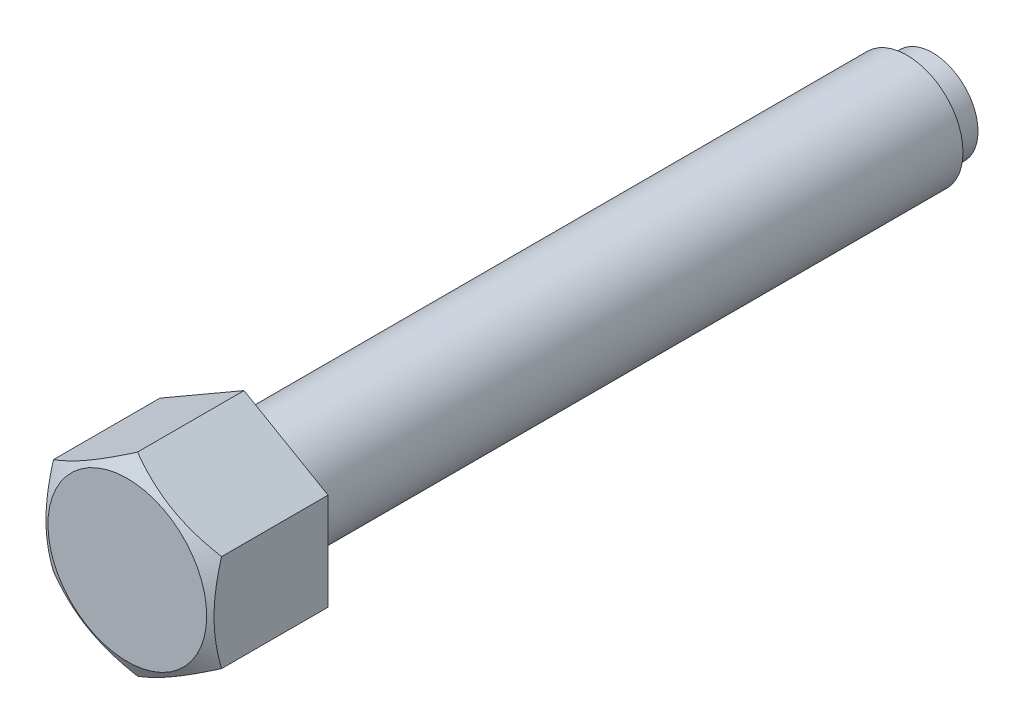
ISO-10303-21;
HEADER;
FILE_DESCRIPTION(('STEP AP214'),'2;1');
FILE_NAME('part.step','',(''),(''),'','','');
FILE_SCHEMA(('AUTOMOTIVE_DESIGN { 1 0 10303 214 1 1 1 1 }'));
ENDSEC;
DATA;
#1=APPLICATION_CONTEXT('core data for automotive mechanical design processes');
#2=APPLICATION_PROTOCOL_DEFINITION('international standard','automotive_design',2000,#1);
#3=PRODUCT_CONTEXT('',#1,'mechanical');
#4=PRODUCT('Part','Part','',(#3));
#5=PRODUCT_RELATED_PRODUCT_CATEGORY('part','',(#4));
#6=PRODUCT_DEFINITION_FORMATION('','',#4);
#7=PRODUCT_DEFINITION_CONTEXT('part definition',#1,'design');
#8=PRODUCT_DEFINITION('design','',#6,#7);
#9=PRODUCT_DEFINITION_SHAPE('','',#8);
#10=(LENGTH_UNIT() NAMED_UNIT(*) SI_UNIT(.MILLI.,.METRE.));
#11=(NAMED_UNIT(*) PLANE_ANGLE_UNIT() SI_UNIT($,.RADIAN.));
#12=(NAMED_UNIT(*) SI_UNIT($,.STERADIAN.) SOLID_ANGLE_UNIT());
#13=UNCERTAINTY_MEASURE_WITH_UNIT(LENGTH_MEASURE(1.E-05),#10,'distance_accuracy_value','');
#14=(GEOMETRIC_REPRESENTATION_CONTEXT(3) GLOBAL_UNCERTAINTY_ASSIGNED_CONTEXT((#13)) GLOBAL_UNIT_ASSIGNED_CONTEXT((#10,
#11,#12)) REPRESENTATION_CONTEXT('',''));
#15=CARTESIAN_POINT('',(0.,0.,0.));
#16=DIRECTION('',(0.,0.,1.));
#17=DIRECTION('',(1.,0.,0.));
#18=AXIS2_PLACEMENT_3D('',#15,#16,#17);
#19=CARTESIAN_POINT('',(0.,20.7846096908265,145.));
#20=DIRECTION('',(-0.5,-0.86602540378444,0.));
#21=DIRECTION('',(0.86602540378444,-0.5,0.));
#22=AXIS2_PLACEMENT_3D('',#19,#20,#21);
#23=PLANE('',#22);
#24=CARTESIAN_POINT('',(18.0002,10.3921893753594,172.814887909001));
#25=CARTESIAN_POINT('',(17.6045674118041,10.6206079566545,172.946756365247));
#26=CARTESIAN_POINT('',(17.2073916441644,10.8499174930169,173.072640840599));
#27=CARTESIAN_POINT('',(16.4098552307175,11.310375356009,173.310778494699));
#28=CARTESIAN_POINT('',(16.0094935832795,11.5415242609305,173.423027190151));
#29=CARTESIAN_POINT('',(15.2048116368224,12.0061075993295,173.632384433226));
#30=CARTESIAN_POINT('',(14.8004842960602,12.2395460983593,173.729457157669));
#31=CARTESIAN_POINT('',(13.9890201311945,12.7080451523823,173.906377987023));
#32=CARTESIAN_POINT('',(13.5818834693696,12.9431056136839,173.98622707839));
#33=CARTESIAN_POINT('',(12.7752328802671,13.4088255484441,174.125304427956));
#34=CARTESIAN_POINT('',(12.3757788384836,13.6394504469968,174.184993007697));
#35=CARTESIAN_POINT('',(11.5750403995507,14.1017570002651,174.285077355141));
#36=CARTESIAN_POINT('',(11.1737559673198,14.3334386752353,174.325472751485));
#37=CARTESIAN_POINT('',(10.370513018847,14.7971912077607,174.385950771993));
#38=CARTESIAN_POINT('',(9.96855587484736,15.0292612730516,174.406057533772));
#39=CARTESIAN_POINT('',(9.16427056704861,15.4936156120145,174.425525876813));
#40=CARTESIAN_POINT('',(8.7619424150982,15.7258998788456,174.424888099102));
#41=CARTESIAN_POINT('',(8.00978065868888,16.1601606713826,174.404316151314));
#42=CARTESIAN_POINT('',(7.65989346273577,16.3621681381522,174.38689054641));
#43=CARTESIAN_POINT('',(6.96095368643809,16.765701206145,174.336680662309));
#44=CARTESIAN_POINT('',(6.61190109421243,16.9672268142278,174.303896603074));
#45=CARTESIAN_POINT('',(5.91476277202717,17.3697198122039,174.223538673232));
#46=CARTESIAN_POINT('',(5.56667820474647,17.5706865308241,174.175951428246));
#47=CARTESIAN_POINT('',(4.87216610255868,17.9716632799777,174.066826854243));
#48=CARTESIAN_POINT('',(4.52573856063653,18.1716733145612,174.005289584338));
#49=CARTESIAN_POINT('',(3.47411308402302,18.7788295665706,173.798187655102));
#50=CARTESIAN_POINT('',(2.77196054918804,19.1842175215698,173.631972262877));
#51=CARTESIAN_POINT('',(1.37812528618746,19.9889486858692,173.254731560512));
#52=CARTESIAN_POINT('',(0.686424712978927,20.3883021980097,173.043794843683));
#53=CARTESIAN_POINT('',(-0.000199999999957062,20.7847251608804,172.814887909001));
#54=B_SPLINE_CURVE_WITH_KNOTS('',3,(#24,#25,#26,#27,#28,#29,#30,#31,#32,#33,#34,#35,#36,#37,#38,
#39,#40,#41,#42,#43,#44,#45,#46,#47,#48,#49,#50,#51,#52,#53),.UNSPECIFIED.,.F.,.F.,(4,2,2,2,2,2,
2,2,2,2,2,2,2,2,4),(0.,1.42650335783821,2.85347447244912,4.28376471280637,5.71397301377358,
7.10888071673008,8.50381526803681,9.8970882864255,11.2903182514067,12.5031974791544,
13.7160593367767,14.9300201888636,16.1439758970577,18.6253607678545,21.1018751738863),.UNSPECIFIED.);
#55=CARTESIAN_POINT('',(18.,10.3923048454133,172.814954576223));
#56=VERTEX_POINT('',#55);
#57=CARTESIAN_POINT('',(0.,20.7846096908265,172.814954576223));
#58=VERTEX_POINT('',#57);
#59=EDGE_CURVE('E30',#56,#58,#54,.T.);
#60=ORIENTED_EDGE('',*,*,#59,.F.);
#61=DIRECTION('',(0.,0.,1.));
#62=VECTOR('',#61,1.);
#63=CARTESIAN_POINT('',(18.,10.3923048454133,145.));
#64=LINE('',#63,#62);
#65=CARTESIAN_POINT('',(18.,10.3923048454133,150.));
#66=VERTEX_POINT('',#65);
#67=EDGE_CURVE('E97',#66,#56,#64,.T.);
#68=ORIENTED_EDGE('',*,*,#67,.F.);
#69=DIRECTION('',(0.86602540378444,-0.5,0.));
#70=VECTOR('',#69,1.);
#71=CARTESIAN_POINT('',(18.,10.3923048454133,150.));
#72=LINE('',#71,#70);
#73=CARTESIAN_POINT('',(0.,20.7846096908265,150.));
#74=VERTEX_POINT('',#73);
#75=EDGE_CURVE('E111',#74,#66,#72,.T.);
#76=ORIENTED_EDGE('',*,*,#75,.F.);
#77=DIRECTION('',(0.,0.,1.));
#78=VECTOR('',#77,1.);
#79=CARTESIAN_POINT('',(0.,20.7846096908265,145.));
#80=LINE('',#79,#78);
#81=EDGE_CURVE('E37',#74,#58,#80,.T.);
#82=ORIENTED_EDGE('',*,*,#81,.T.);
#83=EDGE_LOOP('',(#60,#68,#76,#82));
#84=FACE_BOUND('',#83,.T.);
#85=ADVANCED_FACE('F15',(#84),#23,.F.);
#86=CARTESIAN_POINT('',(18.,10.3923048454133,145.));
#87=DIRECTION('',(-1.,0.,0.));
#88=DIRECTION('',(0.,-1.,0.));
#89=AXIS2_PLACEMENT_3D('',#86,#87,#88);
#90=PLANE('',#89);
#91=CARTESIAN_POINT('',(18.,-27.8084702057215,165.68983135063));
#92=CARTESIAN_POINT('',(18.,-27.4158321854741,165.880129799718));
#93=CARTESIAN_POINT('',(18.,-27.0227305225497,166.06947116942));
#94=CARTESIAN_POINT('',(18.,-26.2355031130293,166.446022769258));
#95=CARTESIAN_POINT('',(18.,-25.841377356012,166.633232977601));
#96=CARTESIAN_POINT('',(18.,-24.6572123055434,167.1913914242));
#97=CARTESIAN_POINT('',(18.,-23.8655030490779,167.558810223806));
#98=CARTESIAN_POINT('',(18.,-22.2723907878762,168.283994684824));
#99=CARTESIAN_POINT('',(18.,-21.4709584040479,168.641695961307));
#100=CARTESIAN_POINT('',(18.,-19.8616825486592,169.342322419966));
#101=CARTESIAN_POINT('',(18.,-19.0538393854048,169.685248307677));
#102=CARTESIAN_POINT('',(18.,-17.4048230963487,170.362945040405));
#103=CARTESIAN_POINT('',(18.,-16.5634026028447,170.697117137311));
#104=CARTESIAN_POINT('',(18.,-14.8706723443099,171.339912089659));
#105=CARTESIAN_POINT('',(18.,-14.0193614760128,171.648532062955));
#106=CARTESIAN_POINT('',(18.,-12.3071522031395,172.232038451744));
#107=CARTESIAN_POINT('',(18.,-11.4462775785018,172.506994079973));
#108=CARTESIAN_POINT('',(18.,-9.71209852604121,173.014293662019));
#109=CARTESIAN_POINT('',(18.,-8.83879814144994,173.246651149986));
#110=CARTESIAN_POINT('',(18.,-7.52178610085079,173.55414713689));
#111=CARTESIAN_POINT('',(18.,-7.08278899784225,173.649604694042));
#112=CARTESIAN_POINT('',(18.,-6.20181532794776,173.825690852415));
#113=CARTESIAN_POINT('',(18.,-5.75983882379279,173.906319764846));
#114=CARTESIAN_POINT('',(18.,-4.87322678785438,174.051317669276));
#115=CARTESIAN_POINT('',(18.,-4.42859133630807,174.115687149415));
#116=CARTESIAN_POINT('',(18.,-3.53711680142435,174.226882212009));
#117=CARTESIAN_POINT('',(18.,-3.09027771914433,174.273707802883));
#118=CARTESIAN_POINT('',(18.,-2.20083325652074,174.348299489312));
#119=CARTESIAN_POINT('',(18.,-1.75824805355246,174.376304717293));
#120=CARTESIAN_POINT('',(18.,-0.872291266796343,174.413580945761));
#121=CARTESIAN_POINT('',(18.,-0.428919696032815,174.422852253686));
#122=CARTESIAN_POINT('',(18.,0.457820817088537,174.42244051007));
#123=CARTESIAN_POINT('',(18.,0.901189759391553,174.412757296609));
#124=CARTESIAN_POINT('',(18.,1.78712731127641,174.374670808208));
#125=CARTESIAN_POINT('',(18.,2.22969588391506,174.346266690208));
#126=CARTESIAN_POINT('',(18.,3.29654995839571,174.255829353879));
#127=CARTESIAN_POINT('',(18.,3.92008059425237,174.184734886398));
#128=CARTESIAN_POINT('',(18.,5.16244762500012,174.009282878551));
#129=CARTESIAN_POINT('',(18.,5.78128335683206,173.904920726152));
#130=CARTESIAN_POINT('',(18.,7.01369263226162,173.666646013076));
#131=CARTESIAN_POINT('',(18.,7.6272616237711,173.532710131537));
#132=CARTESIAN_POINT('',(18.,8.84821250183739,173.239368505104));
#133=CARTESIAN_POINT('',(18.,9.45559448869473,173.079963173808));
#134=CARTESIAN_POINT('',(18.,10.6775127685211,172.735791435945));
#135=CARTESIAN_POINT('',(18.,11.2919127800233,172.550544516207));
#136=CARTESIAN_POINT('',(18.,12.5146588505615,172.161146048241));
#137=CARTESIAN_POINT('',(18.,13.1230048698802,171.956994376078));
#138=CARTESIAN_POINT('',(18.,14.3339482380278,171.533007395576));
#139=CARTESIAN_POINT('',(18.,14.9365474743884,171.313177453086));
#140=CARTESIAN_POINT('',(18.,16.1367677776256,170.860397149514));
#141=CARTESIAN_POINT('',(18.,16.7343889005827,170.627446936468));
#142=CARTESIAN_POINT('',(18.,18.135991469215,170.066209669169));
#143=CARTESIAN_POINT('',(18.,18.9381439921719,169.733362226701));
#144=CARTESIAN_POINT('',(18.,20.5357211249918,169.051849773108));
#145=CARTESIAN_POINT('',(18.,21.3311453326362,168.703183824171));
#146=CARTESIAN_POINT('',(18.,22.9165096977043,167.993181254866));
#147=CARTESIAN_POINT('',(18.,23.7064486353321,167.631841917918));
#148=CARTESIAN_POINT('',(18.,25.281581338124,166.899030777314));
#149=CARTESIAN_POINT('',(18.,26.0667752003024,166.527559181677));
#150=CARTESIAN_POINT('',(18.,27.6340339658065,165.775965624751));
#151=CARTESIAN_POINT('',(18.,28.4160946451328,165.395834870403));
#152=CARTESIAN_POINT('',(18.,29.9768748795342,164.628776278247));
#153=CARTESIAN_POINT('',(18.,30.7555944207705,164.24184841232));
#154=CARTESIAN_POINT('',(18.,32.3101083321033,163.462400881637));
#155=CARTESIAN_POINT('',(18.,33.0859030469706,163.06988190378));
#156=CARTESIAN_POINT('',(18.,34.6350785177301,162.280117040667));
#157=CARTESIAN_POINT('',(18.,35.4084592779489,161.88287116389));
#158=CARTESIAN_POINT('',(18.,37.5974581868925,160.751362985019));
#159=CARTESIAN_POINT('',(18.,39.0106461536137,160.012399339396));
#160=CARTESIAN_POINT('',(18.,41.8317901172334,158.524459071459));
#161=CARTESIAN_POINT('',(18.,43.2397459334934,157.775482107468));
#162=CARTESIAN_POINT('',(18.,46.0481369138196,156.271677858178));
#163=CARTESIAN_POINT('',(18.,47.4485820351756,155.516869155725));
#164=CARTESIAN_POINT('',(18.,49.5467780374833,154.380188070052));
#165=CARTESIAN_POINT('',(18.,50.2457464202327,154.000559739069));
#166=CARTESIAN_POINT('',(18.,51.6429519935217,153.239962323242));
#167=CARTESIAN_POINT('',(18.,52.3411891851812,152.858993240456));
#168=CARTESIAN_POINT('',(18.,53.0391020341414,152.477430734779));
#169=B_SPLINE_CURVE_WITH_KNOTS('',3,(#91,#92,#93,#94,#95,#96,#97,#98,#99,#100,#101,#102,#103,
#104,#105,#106,#107,#108,#109,#110,#111,#112,#113,#114,#115,#116,#117,#118,#119,#120,#121,#122,
#123,#124,#125,#126,#127,#128,#129,#130,#131,#132,#133,#134,#135,#136,#137,#138,#139,#140,#141,
#142,#143,#144,#145,#146,#147,#148,#149,#150,#151,#152,#153,#154,#155,#156,#157,#158,#159,#160,
#161,#162,#163,#164,#165,#166,#167,#168),.UNSPECIFIED.,.F.,.F.,(4,2,2,2,2,2,2,2,2,2,2,2,2,2,2,2,
2,2,2,2,2,2,2,2,2,2,2,2,2,2,2,2,2,2,2,2,2,2,4),(0.,1.30896781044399,2.61794899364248,
5.23630431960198,7.86909466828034,10.501759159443,13.2174936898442,15.9335341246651,
18.6438932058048,21.353389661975,22.7009465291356,24.0484751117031,25.3959632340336,
26.7434507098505,28.0734757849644,29.4034790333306,30.7334936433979,32.063568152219,
33.9452364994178,35.8271658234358,37.7105845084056,39.5939726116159,41.5187666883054,
43.4435733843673,45.3677244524,47.2918538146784,49.8970272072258,52.5023552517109,
55.1082452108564,57.7140817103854,60.3226940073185,62.9313170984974,65.539622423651,
68.1479230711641,72.9320558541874,77.7163523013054,82.4890511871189,84.8752752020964,
87.2614955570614),.UNSPECIFIED.);
#170=CARTESIAN_POINT('',(18.,-10.3923048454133,172.814954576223));
#171=VERTEX_POINT('',#170);
#172=EDGE_CURVE('E157',#171,#56,#169,.T.);
#173=ORIENTED_EDGE('',*,*,#172,.F.);
#174=DIRECTION('',(0.,0.,1.));
#175=VECTOR('',#174,1.);
#176=CARTESIAN_POINT('',(18.,-10.3923048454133,145.));
#177=LINE('',#176,#175);
#178=CARTESIAN_POINT('',(18.,-10.3923048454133,150.));
#179=VERTEX_POINT('',#178);
#180=EDGE_CURVE('E94',#179,#171,#177,.T.);
#181=ORIENTED_EDGE('',*,*,#180,.F.);
#182=DIRECTION('',(0.,-1.,0.));
#183=VECTOR('',#182,1.);
#184=CARTESIAN_POINT('',(18.,0.,150.));
#185=LINE('',#184,#183);
#186=EDGE_CURVE('E108',#66,#179,#185,.T.);
#187=ORIENTED_EDGE('',*,*,#186,.F.);
#188=ORIENTED_EDGE('',*,*,#67,.T.);
#189=EDGE_LOOP('',(#173,#181,#187,#188));
#190=FACE_BOUND('',#189,.T.);
#191=ADVANCED_FACE('F137',(#190),#90,.F.);
#192=CARTESIAN_POINT('',(0.,-20.7846096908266,145.));
#193=DIRECTION('',(0.5,-0.866025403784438,0.));
#194=DIRECTION('',(0.866025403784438,0.5,0.));
#195=AXIS2_PLACEMENT_3D('',#192,#193,#194);
#196=PLANE('',#195);
#197=ORIENTED_EDGE('',*,*,#180,.T.);
#198=CARTESIAN_POINT('',(18.0002,-10.3921893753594,172.814887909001));
#199=CARTESIAN_POINT('',(17.6045674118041,-10.6206079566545,172.946756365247));
#200=CARTESIAN_POINT('',(17.2073916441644,-10.8499174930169,173.072640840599));
#201=CARTESIAN_POINT('',(16.4098552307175,-11.310375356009,173.310778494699));
#202=CARTESIAN_POINT('',(16.0094935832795,-11.5415242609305,173.423027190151));
#203=CARTESIAN_POINT('',(15.2048116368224,-12.0061075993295,173.632384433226));
#204=CARTESIAN_POINT('',(14.8004842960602,-12.2395460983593,173.729457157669));
#205=CARTESIAN_POINT('',(13.9890201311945,-12.7080451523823,173.906377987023));
#206=CARTESIAN_POINT('',(13.5818834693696,-12.9431056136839,173.98622707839));
#207=CARTESIAN_POINT('',(12.7752328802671,-13.4088255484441,174.125304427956));
#208=CARTESIAN_POINT('',(12.3757788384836,-13.6394504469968,174.184993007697));
#209=CARTESIAN_POINT('',(11.5750403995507,-14.1017570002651,174.285077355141));
#210=CARTESIAN_POINT('',(11.1737559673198,-14.3334386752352,174.325472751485));
#211=CARTESIAN_POINT('',(10.370513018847,-14.7971912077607,174.385950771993));
#212=CARTESIAN_POINT('',(9.96855587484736,-15.0292612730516,174.406057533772));
#213=CARTESIAN_POINT('',(9.16427056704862,-15.4936156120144,174.425525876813));
#214=CARTESIAN_POINT('',(8.76194241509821,-15.7258998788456,174.424888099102));
#215=CARTESIAN_POINT('',(8.00978065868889,-16.1601606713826,174.404316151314));
#216=CARTESIAN_POINT('',(7.65989346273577,-16.3621681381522,174.38689054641));
#217=CARTESIAN_POINT('',(6.96095368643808,-16.765701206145,174.336680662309));
#218=CARTESIAN_POINT('',(6.61190109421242,-16.9672268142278,174.303896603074));
#219=CARTESIAN_POINT('',(5.91476277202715,-17.3697198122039,174.223538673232));
#220=CARTESIAN_POINT('',(5.56667820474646,-17.5706865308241,174.175951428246));
#221=CARTESIAN_POINT('',(4.87216610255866,-17.9716632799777,174.066826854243));
#222=CARTESIAN_POINT('',(4.5257385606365,-18.1716733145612,174.005289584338));
#223=CARTESIAN_POINT('',(3.47411308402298,-18.7788295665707,173.798187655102));
#224=CARTESIAN_POINT('',(2.771960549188,-19.1842175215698,173.631972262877));
#225=CARTESIAN_POINT('',(1.3781252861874,-19.9889486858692,173.254731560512));
#226=CARTESIAN_POINT('',(0.686424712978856,-20.3883021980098,173.043794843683));
#227=CARTESIAN_POINT('',(-0.000200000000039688,-20.7847251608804,172.814887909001));
#228=B_SPLINE_CURVE_WITH_KNOTS('',3,(#198,#199,#200,#201,#202,#203,#204,#205,#206,#207,#208,
#209,#210,#211,#212,#213,#214,#215,#216,#217,#218,#219,#220,#221,#222,#223,#224,#225,#226,#227),
.UNSPECIFIED.,.F.,.F.,(4,2,2,2,2,2,2,2,2,2,2,2,2,2,4),(0.,1.42650335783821,2.85347447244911,
4.28376471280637,5.71397301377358,7.10888071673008,8.5038152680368,9.89708828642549,
11.2903182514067,12.5031974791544,13.7160593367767,14.9300201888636,16.1439758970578,
18.6253607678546,21.1018751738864),.UNSPECIFIED.);
#229=CARTESIAN_POINT('',(0.,-20.7846096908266,172.814954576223));
#230=VERTEX_POINT('',#229);
#231=EDGE_CURVE('E163',#171,#230,#228,.T.);
#232=ORIENTED_EDGE('',*,*,#231,.T.);
#233=DIRECTION('',(0.,0.,1.));
#234=VECTOR('',#233,1.);
#235=CARTESIAN_POINT('',(0.,-20.7846096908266,145.));
#236=LINE('',#235,#234);
#237=CARTESIAN_POINT('',(0.,-20.7846096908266,150.));
#238=VERTEX_POINT('',#237);
#239=EDGE_CURVE('E87',#238,#230,#236,.T.);
#240=ORIENTED_EDGE('',*,*,#239,.F.);
#241=DIRECTION('',(0.866025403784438,0.5,0.));
#242=VECTOR('',#241,1.);
#243=CARTESIAN_POINT('',(18.,-10.3923048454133,150.));
#244=LINE('',#243,#242);
#245=EDGE_CURVE('E106',#238,#179,#244,.T.);
#246=ORIENTED_EDGE('',*,*,#245,.T.);
#247=EDGE_LOOP('',(#197,#232,#240,#246));
#248=FACE_BOUND('',#247,.T.);
#249=ADVANCED_FACE('F143',(#248),#196,.T.);
#250=CARTESIAN_POINT('',(0.,-20.7846096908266,145.));
#251=DIRECTION('',(0.5,0.866025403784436,0.));
#252=DIRECTION('',(-0.866025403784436,0.5,0.));
#253=AXIS2_PLACEMENT_3D('',#250,#251,#252);
#254=PLANE('',#253);
#255=CARTESIAN_POINT('',(-18.0002,-10.3921893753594,172.814887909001));
#256=CARTESIAN_POINT('',(-17.6045674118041,-10.6206079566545,172.946756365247));
#257=CARTESIAN_POINT('',(-17.2073916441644,-10.8499174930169,173.072640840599));
#258=CARTESIAN_POINT('',(-16.4098552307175,-11.310375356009,173.310778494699));
#259=CARTESIAN_POINT('',(-16.0094935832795,-11.5415242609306,173.423027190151));
#260=CARTESIAN_POINT('',(-15.2048116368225,-12.0061075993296,173.632384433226));
#261=CARTESIAN_POINT('',(-14.8004842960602,-12.2395460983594,173.729457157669));
#262=CARTESIAN_POINT('',(-13.9890201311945,-12.7080451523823,173.906377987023));
#263=CARTESIAN_POINT('',(-13.5818834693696,-12.9431056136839,173.98622707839));
#264=CARTESIAN_POINT('',(-12.7752328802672,-13.4088255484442,174.125304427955));
#265=CARTESIAN_POINT('',(-12.3757788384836,-13.6394504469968,174.184993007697));
#266=CARTESIAN_POINT('',(-11.5750403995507,-14.1017570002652,174.285077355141));
#267=CARTESIAN_POINT('',(-11.1737559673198,-14.3334386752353,174.325472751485));
#268=CARTESIAN_POINT('',(-10.3705130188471,-14.7971912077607,174.385950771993));
#269=CARTESIAN_POINT('',(-9.96855587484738,-15.0292612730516,174.406057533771));
#270=CARTESIAN_POINT('',(-9.16427056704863,-15.4936156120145,174.425525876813));
#271=CARTESIAN_POINT('',(-8.76194241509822,-15.7258998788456,174.424888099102));
#272=CARTESIAN_POINT('',(-8.0097806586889,-16.1601606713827,174.404316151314));
#273=CARTESIAN_POINT('',(-7.65989346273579,-16.3621681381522,174.38689054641));
#274=CARTESIAN_POINT('',(-6.96095368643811,-16.765701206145,174.336680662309));
#275=CARTESIAN_POINT('',(-6.61190109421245,-16.9672268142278,174.303896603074));
#276=CARTESIAN_POINT('',(-5.91476277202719,-17.3697198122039,174.223538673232));
#277=CARTESIAN_POINT('',(-5.56667820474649,-17.5706865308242,174.175951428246));
#278=CARTESIAN_POINT('',(-4.8721661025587,-17.9716632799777,174.066826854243));
#279=CARTESIAN_POINT('',(-4.52573856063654,-18.1716733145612,174.005289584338));
#280=CARTESIAN_POINT('',(-3.47411308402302,-18.7788295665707,173.798187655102));
#281=CARTESIAN_POINT('',(-2.77196054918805,-19.1842175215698,173.631972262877));
#282=CARTESIAN_POINT('',(-1.37812528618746,-19.9889486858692,173.254731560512));
#283=CARTESIAN_POINT('',(-0.686424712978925,-20.3883021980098,173.043794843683));
#284=CARTESIAN_POINT('',(0.000199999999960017,-20.7847251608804,172.814887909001));
#285=B_SPLINE_CURVE_WITH_KNOTS('',3,(#255,#256,#257,#258,#259,#260,#261,#262,#263,#264,#265,
#266,#267,#268,#269,#270,#271,#272,#273,#274,#275,#276,#277,#278,#279,#280,#281,#282,#283,#284),
.UNSPECIFIED.,.F.,.F.,(4,2,2,2,2,2,2,2,2,2,2,2,2,2,4),(0.,1.42650335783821,2.85347447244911,
4.28376471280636,5.71397301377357,7.10888071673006,8.50381526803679,9.89708828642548,
11.2903182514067,12.5031974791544,13.7160593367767,14.9300201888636,16.1439758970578,
18.6253607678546,21.1018751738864),.UNSPECIFIED.);
#286=CARTESIAN_POINT('',(-18.,-10.3923048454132,172.814954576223));
#287=VERTEX_POINT('',#286);
#288=EDGE_CURVE('E81',#287,#230,#285,.T.);
#289=ORIENTED_EDGE('',*,*,#288,.F.);
#290=DIRECTION('',(0.,0.,1.));
#291=VECTOR('',#290,1.);
#292=CARTESIAN_POINT('',(-18.,-10.3923048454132,145.));
#293=LINE('',#292,#291);
#294=CARTESIAN_POINT('',(-18.,-10.3923048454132,150.));
#295=VERTEX_POINT('',#294);
#296=EDGE_CURVE('E80',#295,#287,#293,.T.);
#297=ORIENTED_EDGE('',*,*,#296,.F.);
#298=DIRECTION('',(-0.866025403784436,0.5,0.));
#299=VECTOR('',#298,1.);
#300=CARTESIAN_POINT('',(-1.35308431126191E-13,-20.7846096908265,150.));
#301=LINE('',#300,#299);
#302=EDGE_CURVE('E103',#238,#295,#301,.T.);
#303=ORIENTED_EDGE('',*,*,#302,.F.);
#304=ORIENTED_EDGE('',*,*,#239,.T.);
#305=EDGE_LOOP('',(#289,#297,#303,#304));
#306=FACE_BOUND('',#305,.T.);
#307=ADVANCED_FACE('F239',(#306),#254,.F.);
#308=CARTESIAN_POINT('',(-18.,10.3923048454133,145.));
#309=DIRECTION('',(-1.,0.,0.));
#310=DIRECTION('',(0.,0.,1.));
#311=AXIS2_PLACEMENT_3D('',#308,#309,#310);
#312=PLANE('',#311);
#313=ORIENTED_EDGE('',*,*,#296,.T.);
#314=CARTESIAN_POINT('',(-18.,-27.8084702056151,165.689831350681));
#315=CARTESIAN_POINT('',(-18.,-27.4158321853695,165.880129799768));
#316=CARTESIAN_POINT('',(-18.,-27.0227305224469,166.06947116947));
#317=CARTESIAN_POINT('',(-18.,-26.23550311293,166.446022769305));
#318=CARTESIAN_POINT('',(-18.,-25.8413773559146,166.633232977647));
#319=CARTESIAN_POINT('',(-18.,-24.6572123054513,167.191391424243));
#320=CARTESIAN_POINT('',(-18.,-23.8655030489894,167.558810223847));
#321=CARTESIAN_POINT('',(-18.,-22.2723907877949,168.28399468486));
#322=CARTESIAN_POINT('',(-18.,-21.4709584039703,168.641695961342));
#323=CARTESIAN_POINT('',(-18.,-19.8616825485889,169.342322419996));
#324=CARTESIAN_POINT('',(-18.,-19.0538393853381,169.685248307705));
#325=CARTESIAN_POINT('',(-18.,-17.4048230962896,170.362945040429));
#326=CARTESIAN_POINT('',(-18.,-16.5634026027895,170.697117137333));
#327=CARTESIAN_POINT('',(-18.,-14.8706723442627,171.339912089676));
#328=CARTESIAN_POINT('',(-18.,-14.0193614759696,171.648532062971));
#329=CARTESIAN_POINT('',(-18.,-12.3071522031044,172.232038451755));
#330=CARTESIAN_POINT('',(-18.,-11.4462775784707,172.506994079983));
#331=CARTESIAN_POINT('',(-18.,-9.71209852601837,173.014293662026));
#332=CARTESIAN_POINT('',(-18.,-8.83879814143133,173.246651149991));
#333=CARTESIAN_POINT('',(-18.,-7.52178610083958,173.554147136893));
#334=CARTESIAN_POINT('',(-18.,-7.08278899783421,173.649604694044));
#335=CARTESIAN_POINT('',(-18.,-6.20181532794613,173.825690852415));
#336=CARTESIAN_POINT('',(-18.,-5.7598388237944,173.906319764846));
#337=CARTESIAN_POINT('',(-18.,-4.87322678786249,174.051317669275));
#338=CARTESIAN_POINT('',(-18.,-4.42859133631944,174.115687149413));
#339=CARTESIAN_POINT('',(-18.,-3.53711680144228,174.226882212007));
#340=CARTESIAN_POINT('',(-18.,-3.09027771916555,174.273707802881));
#341=CARTESIAN_POINT('',(-18.,-2.20083325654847,174.34829948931));
#342=CARTESIAN_POINT('',(-18.,-1.75824805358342,174.376304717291));
#343=CARTESIAN_POINT('',(-18.,-0.872291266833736,174.41358094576));
#344=CARTESIAN_POINT('',(-18.,-0.428919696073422,174.422852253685));
#345=CARTESIAN_POINT('',(-18.,0.457820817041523,174.42244051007));
#346=CARTESIAN_POINT('',(-18.,0.901189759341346,174.41275729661));
#347=CARTESIAN_POINT('',(-18.,1.78712731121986,174.374670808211));
#348=CARTESIAN_POINT('',(-18.,2.22969588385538,174.346266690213));
#349=CARTESIAN_POINT('',(-18.,3.29654995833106,174.255829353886));
#350=CARTESIAN_POINT('',(-18.,3.92008059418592,174.184734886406));
#351=CARTESIAN_POINT('',(-18.,5.16244762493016,174.009282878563));
#352=CARTESIAN_POINT('',(-18.,5.78128335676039,173.904920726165));
#353=CARTESIAN_POINT('',(-18.,7.0136926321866,173.666646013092));
#354=CARTESIAN_POINT('',(-18.,7.62726162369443,173.532710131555));
#355=CARTESIAN_POINT('',(-18.,8.84821250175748,173.239368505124));
#356=CARTESIAN_POINT('',(-18.,9.45559448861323,173.079963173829));
#357=CARTESIAN_POINT('',(-18.,10.6775127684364,172.73579143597));
#358=CARTESIAN_POINT('',(-18.,11.2919127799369,172.550544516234));
#359=CARTESIAN_POINT('',(-18.,12.5146588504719,172.161146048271));
#360=CARTESIAN_POINT('',(-18.,13.123004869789,171.956994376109));
#361=CARTESIAN_POINT('',(-18.,14.3339482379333,171.53300739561));
#362=CARTESIAN_POINT('',(-18.,14.9365474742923,171.313177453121));
#363=CARTESIAN_POINT('',(-18.,16.1367677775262,170.860397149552));
#364=CARTESIAN_POINT('',(-18.,16.7343889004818,170.627446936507));
#365=CARTESIAN_POINT('',(-18.,18.1359914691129,170.06620966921));
#366=CARTESIAN_POINT('',(-18.,18.9381439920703,169.733362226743));
#367=CARTESIAN_POINT('',(-18.,20.535721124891,169.051849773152));
#368=CARTESIAN_POINT('',(-18.,21.3311453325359,168.703183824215));
#369=CARTESIAN_POINT('',(-18.,22.9165096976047,167.993181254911));
#370=CARTESIAN_POINT('',(-18.,23.7064486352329,167.631841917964));
#371=CARTESIAN_POINT('',(-18.,25.2815813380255,166.899030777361));
#372=CARTESIAN_POINT('',(-18.,26.0667752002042,166.527559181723));
#373=CARTESIAN_POINT('',(-18.,27.6340339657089,165.775965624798));
#374=CARTESIAN_POINT('',(-18.,28.4160946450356,165.39583487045));
#375=CARTESIAN_POINT('',(-18.,29.9768748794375,164.628776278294));
#376=CARTESIAN_POINT('',(-18.,30.7555944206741,164.241848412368));
#377=CARTESIAN_POINT('',(-18.,32.3101083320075,163.462400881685));
#378=CARTESIAN_POINT('',(-18.,33.0859030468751,163.069881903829));
#379=CARTESIAN_POINT('',(-18.,34.6350785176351,162.280117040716));
#380=CARTESIAN_POINT('',(-18.,35.4084592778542,161.882871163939));
#381=CARTESIAN_POINT('',(-18.,37.5974581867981,160.751362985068));
#382=CARTESIAN_POINT('',(-18.,39.0106461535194,160.012399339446));
#383=CARTESIAN_POINT('',(-18.,41.8317901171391,158.524459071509));
#384=CARTESIAN_POINT('',(-18.,43.2397459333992,157.775482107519));
#385=CARTESIAN_POINT('',(-18.,46.0481369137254,156.271677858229));
#386=CARTESIAN_POINT('',(-18.,47.4485820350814,155.516869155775));
#387=CARTESIAN_POINT('',(-18.,49.546778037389,154.380188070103));
#388=CARTESIAN_POINT('',(-18.,50.2457464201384,154.00055973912));
#389=CARTESIAN_POINT('',(-18.,51.6429519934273,153.239962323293));
#390=CARTESIAN_POINT('',(-18.,52.3411891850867,152.858993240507));
#391=CARTESIAN_POINT('',(-18.,53.0391020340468,152.477430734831));
#392=B_SPLINE_CURVE_WITH_KNOTS('',3,(#314,#315,#316,#317,#318,#319,#320,#321,#322,#323,#324,
#325,#326,#327,#328,#329,#330,#331,#332,#333,#334,#335,#336,#337,#338,#339,#340,#341,#342,#343,
#344,#345,#346,#347,#348,#349,#350,#351,#352,#353,#354,#355,#356,#357,#358,#359,#360,#361,#362,
#363,#364,#365,#366,#367,#368,#369,#370,#371,#372,#373,#374,#375,#376,#377,#378,#379,#380,#381,
#382,#383,#384,#385,#386,#387,#388,#389,#390,#391),.UNSPECIFIED.,.F.,.F.,(4,2,2,2,2,2,2,2,2,2,2,
2,2,2,2,2,2,2,2,2,2,2,2,2,2,2,2,2,2,2,2,2,2,2,2,2,2,2,4),(0.,1.30896781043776,2.61794899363,
5.23630431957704,7.8690946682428,10.5017591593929,13.2174936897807,15.9335341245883,
18.6438932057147,21.3533896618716,22.7009465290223,24.04847511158,25.3959632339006,
26.7434507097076,28.073475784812,29.4034790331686,30.7334936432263,32.0635681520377,
33.9452364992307,35.8271658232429,37.7105845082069,39.5939726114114,41.5187666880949,
43.4435733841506,45.3677244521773,47.2918538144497,49.8970272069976,52.5023552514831,
55.1082452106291,57.7140817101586,60.3226940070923,62.9313170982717,65.5396224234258,
68.1479230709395,72.9320558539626,77.7163523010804,82.4890511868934,84.8752752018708,
87.2614955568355),.UNSPECIFIED.);
#393=CARTESIAN_POINT('',(-18.,10.3923048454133,172.814954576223));
#394=VERTEX_POINT('',#393);
#395=EDGE_CURVE('E68',#287,#394,#392,.T.);
#396=ORIENTED_EDGE('',*,*,#395,.T.);
#397=DIRECTION('',(0.,0.,1.));
#398=VECTOR('',#397,1.);
#399=CARTESIAN_POINT('',(-18.,10.3923048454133,145.));
#400=LINE('',#399,#398);
#401=CARTESIAN_POINT('',(-18.,10.3923048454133,150.));
#402=VERTEX_POINT('',#401);
#403=EDGE_CURVE('E77',#402,#394,#400,.T.);
#404=ORIENTED_EDGE('',*,*,#403,.F.);
#405=DIRECTION('',(0.,-1.,0.));
#406=VECTOR('',#405,1.);
#407=CARTESIAN_POINT('',(-18.,0.,150.));
#408=LINE('',#407,#406);
#409=EDGE_CURVE('E101',#402,#295,#408,.T.);
#410=ORIENTED_EDGE('',*,*,#409,.T.);
#411=EDGE_LOOP('',(#313,#396,#404,#410));
#412=FACE_BOUND('',#411,.T.);
#413=ADVANCED_FACE('F76',(#412),#312,.T.);
#414=CARTESIAN_POINT('',(0.,20.7846096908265,145.));
#415=DIRECTION('',(-0.5,0.866025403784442,0.));
#416=DIRECTION('',(-0.866025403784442,-0.5,0.));
#417=AXIS2_PLACEMENT_3D('',#414,#415,#416);
#418=PLANE('',#417);
#419=ORIENTED_EDGE('',*,*,#403,.T.);
#420=CARTESIAN_POINT('',(-18.0002,10.3921893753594,172.814887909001));
#421=CARTESIAN_POINT('',(-17.6045674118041,10.6206079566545,172.946756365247));
#422=CARTESIAN_POINT('',(-17.2073916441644,10.8499174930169,173.072640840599));
#423=CARTESIAN_POINT('',(-16.4098552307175,11.310375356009,173.310778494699));
#424=CARTESIAN_POINT('',(-16.0094935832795,11.5415242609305,173.423027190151));
#425=CARTESIAN_POINT('',(-15.2048116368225,12.0061075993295,173.632384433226));
#426=CARTESIAN_POINT('',(-14.8004842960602,12.2395460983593,173.729457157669));
#427=CARTESIAN_POINT('',(-13.9890201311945,12.7080451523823,173.906377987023));
#428=CARTESIAN_POINT('',(-13.5818834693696,12.9431056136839,173.98622707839));
#429=CARTESIAN_POINT('',(-12.7752328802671,13.4088255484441,174.125304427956));
#430=CARTESIAN_POINT('',(-12.3757788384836,13.6394504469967,174.184993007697));
#431=CARTESIAN_POINT('',(-11.5750403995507,14.1017570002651,174.285077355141));
#432=CARTESIAN_POINT('',(-11.1737559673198,14.3334386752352,174.325472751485));
#433=CARTESIAN_POINT('',(-10.370513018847,14.7971912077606,174.385950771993));
#434=CARTESIAN_POINT('',(-9.96855587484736,15.0292612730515,174.406057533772));
#435=CARTESIAN_POINT('',(-9.16427056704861,15.4936156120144,174.425525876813));
#436=CARTESIAN_POINT('',(-8.7619424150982,15.7258998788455,174.424888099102));
#437=CARTESIAN_POINT('',(-8.00978065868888,16.1601606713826,174.404316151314));
#438=CARTESIAN_POINT('',(-7.65989346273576,16.3621681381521,174.38689054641));
#439=CARTESIAN_POINT('',(-6.96095368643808,16.7657012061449,174.336680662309));
#440=CARTESIAN_POINT('',(-6.61190109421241,16.9672268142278,174.303896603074));
#441=CARTESIAN_POINT('',(-5.91476277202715,17.3697198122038,174.223538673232));
#442=CARTESIAN_POINT('',(-5.56667820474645,17.5706865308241,174.175951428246));
#443=CARTESIAN_POINT('',(-4.87216610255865,17.9716632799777,174.066826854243));
#444=CARTESIAN_POINT('',(-4.52573856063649,18.1716733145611,174.005289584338));
#445=CARTESIAN_POINT('',(-3.47411308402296,18.7788295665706,173.798187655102));
#446=CARTESIAN_POINT('',(-2.77196054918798,19.1842175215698,173.631972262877));
#447=CARTESIAN_POINT('',(-1.37812528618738,19.9889486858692,173.254731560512));
#448=CARTESIAN_POINT('',(-0.686424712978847,20.3883021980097,173.043794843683));
#449=CARTESIAN_POINT('',(0.000200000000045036,20.7847251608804,172.814887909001));
#450=B_SPLINE_CURVE_WITH_KNOTS('',3,(#420,#421,#422,#423,#424,#425,#426,#427,#428,#429,#430,
#431,#432,#433,#434,#435,#436,#437,#438,#439,#440,#441,#442,#443,#444,#445,#446,#447,#448,#449),
.UNSPECIFIED.,.F.,.F.,(4,2,2,2,2,2,2,2,2,2,2,2,2,2,4),(0.,1.42650335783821,2.85347447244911,
4.28376471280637,5.71397301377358,7.10888071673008,8.5038152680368,9.89708828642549,
11.2903182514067,12.5031974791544,13.7160593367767,14.9300201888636,16.1439758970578,
18.6253607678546,21.1018751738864),.UNSPECIFIED.);
#451=EDGE_CURVE('E65',#394,#58,#450,.T.);
#452=ORIENTED_EDGE('',*,*,#451,.T.);
#453=ORIENTED_EDGE('',*,*,#81,.F.);
#454=DIRECTION('',(-0.866025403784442,-0.5,0.));
#455=VECTOR('',#454,1.);
#456=CARTESIAN_POINT('',(1.43982048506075E-13,20.7846096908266,150.));
#457=LINE('',#456,#455);
#458=EDGE_CURVE('E85',#74,#402,#457,.T.);
#459=ORIENTED_EDGE('',*,*,#458,.T.);
#460=EDGE_LOOP('',(#419,#452,#453,#459));
#461=FACE_BOUND('',#460,.T.);
#462=ADVANCED_FACE('F83',(#461),#418,.T.);
#463=CARTESIAN_POINT('',(0.,0.,20.));
#464=DIRECTION('',(0.,0.,1.));
#465=DIRECTION('',(1.,0.,0.));
#466=AXIS2_PLACEMENT_3D('',#463,#464,#465);
#467=SPHERICAL_SURFACE('',#466,20.);
#468=CARTESIAN_POINT('',(0.,0.,2.53754026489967));
#469=DIRECTION('',(0.,0.,1.));
#470=DIRECTION('',(1.,0.,0.));
#471=AXIS2_PLACEMENT_3D('',#468,#469,#470);
#472=CIRCLE('',#471,9.75);
#473=CARTESIAN_POINT('',(9.75,0.,2.53754026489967));
#474=VERTEX_POINT('',#473);
#475=EDGE_CURVE('E9',#474,#474,#472,.T.);
#476=ORIENTED_EDGE('',*,*,#475,.F.);
#477=EDGE_LOOP('',(#476));
#478=FACE_BOUND('',#477,.T.);
#479=ADVANCED_FACE('F17',(#478),#467,.T.);
#480=CARTESIAN_POINT('',(0.,0.,110.));
#481=DIRECTION('',(0.,0.,1.));
#482=DIRECTION('',(1.,0.,0.));
#483=AXIS2_PLACEMENT_3D('',#480,#481,#482);
#484=CYLINDRICAL_SURFACE('',#483,9.75);
#485=ORIENTED_EDGE('',*,*,#475,.T.);
#486=EDGE_LOOP('',(#485));
#487=FACE_BOUND('',#486,.T.);
#488=CARTESIAN_POINT('',(0.,0.,8.));
#489=DIRECTION('',(0.,0.,1.));
#490=DIRECTION('',(1.,0.,0.));
#491=AXIS2_PLACEMENT_3D('',#488,#489,#490);
#492=CIRCLE('',#491,9.75);
#493=CARTESIAN_POINT('',(9.75,0.,8.));
#494=VERTEX_POINT('',#493);
#495=EDGE_CURVE('E23',#494,#494,#492,.T.);
#496=ORIENTED_EDGE('',*,*,#495,.F.);
#497=EDGE_LOOP('',(#496));
#498=FACE_BOUND('',#497,.T.);
#499=ADVANCED_FACE('F124',(#487,#498),#484,.T.);
#500=CARTESIAN_POINT('',(9.75,0.,8.));
#501=DIRECTION('',(0.,0.,1.));
#502=DIRECTION('',(1.,0.,0.));
#503=AXIS2_PLACEMENT_3D('',#500,#501,#502);
#504=PLANE('',#503);
#505=CARTESIAN_POINT('',(0.,0.,8.));
#506=DIRECTION('',(0.,0.,1.));
#507=DIRECTION('',(1.,0.,0.));
#508=AXIS2_PLACEMENT_3D('',#505,#506,#507);
#509=CIRCLE('',#508,12.);
#510=CARTESIAN_POINT('',(12.,0.,8.));
#511=VERTEX_POINT('',#510);
#512=EDGE_CURVE('E117',#511,#511,#509,.T.);
#513=ORIENTED_EDGE('',*,*,#512,.F.);
#514=EDGE_LOOP('',(#513));
#515=FACE_BOUND('',#514,.T.);
#516=ORIENTED_EDGE('',*,*,#495,.T.);
#517=EDGE_LOOP('',(#516));
#518=FACE_BOUND('',#517,.T.);
#519=ADVANCED_FACE('F122',(#515,#518),#504,.F.);
#520=CARTESIAN_POINT('',(0.,0.,110.));
#521=DIRECTION('',(0.,0.,1.));
#522=DIRECTION('',(1.,0.,0.));
#523=AXIS2_PLACEMENT_3D('',#520,#521,#522);
#524=CYLINDRICAL_SURFACE('',#523,12.);
#525=CARTESIAN_POINT('',(0.,0.,150.));
#526=DIRECTION('',(0.,0.,1.));
#527=DIRECTION('',(1.,0.,0.));
#528=AXIS2_PLACEMENT_3D('',#525,#526,#527);
#529=CIRCLE('',#528,12.);
#530=CARTESIAN_POINT('',(12.,0.,150.));
#531=VERTEX_POINT('',#530);
#532=EDGE_CURVE('E114',#531,#531,#529,.T.);
#533=ORIENTED_EDGE('',*,*,#532,.F.);
#534=EDGE_LOOP('',(#533));
#535=FACE_BOUND('',#534,.T.);
#536=ORIENTED_EDGE('',*,*,#512,.T.);
#537=EDGE_LOOP('',(#536));
#538=FACE_BOUND('',#537,.T.);
#539=ADVANCED_FACE('F132',(#535,#538),#524,.T.);
#540=CARTESIAN_POINT('',(12.,0.,150.));
#541=DIRECTION('',(0.,0.,1.));
#542=DIRECTION('',(1.,0.,0.));
#543=AXIS2_PLACEMENT_3D('',#540,#541,#542);
#544=PLANE('',#543);
#545=ORIENTED_EDGE('',*,*,#458,.F.);
#546=ORIENTED_EDGE('',*,*,#75,.T.);
#547=ORIENTED_EDGE('',*,*,#186,.T.);
#548=ORIENTED_EDGE('',*,*,#245,.F.);
#549=ORIENTED_EDGE('',*,*,#302,.T.);
#550=ORIENTED_EDGE('',*,*,#409,.F.);
#551=EDGE_LOOP('',(#545,#546,#547,#548,#549,#550));
#552=FACE_BOUND('',#551,.T.);
#553=ORIENTED_EDGE('',*,*,#532,.T.);
#554=EDGE_LOOP('',(#553));
#555=FACE_BOUND('',#554,.T.);
#556=ADVANCED_FACE('F178',(#552,#555),#544,.F.);
#557=CARTESIAN_POINT('',(0.,0.,175.));
#558=DIRECTION('',(0.,0.,-1.));
#559=DIRECTION('',(-1.,0.,0.));
#560=AXIS2_PLACEMENT_3D('',#557,#558,#559);
#561=CONICAL_SURFACE('',#560,17.,1.0471975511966);
#562=CARTESIAN_POINT('',(0.,0.,175.));
#563=DIRECTION('',(0.,0.,1.));
#564=DIRECTION('',(1.,0.,0.));
#565=AXIS2_PLACEMENT_3D('',#562,#563,#564);
#566=CIRCLE('',#565,17.);
#567=CARTESIAN_POINT('',(17.,0.,175.));
#568=VERTEX_POINT('',#567);
#569=EDGE_CURVE('E71',#568,#568,#566,.T.);
#570=ORIENTED_EDGE('',*,*,#569,.F.);
#571=EDGE_LOOP('',(#570));
#572=FACE_BOUND('',#571,.T.);
#573=ORIENTED_EDGE('',*,*,#59,.T.);
#574=ORIENTED_EDGE('',*,*,#451,.F.);
#575=ORIENTED_EDGE('',*,*,#395,.F.);
#576=ORIENTED_EDGE('',*,*,#288,.T.);
#577=ORIENTED_EDGE('',*,*,#231,.F.);
#578=ORIENTED_EDGE('',*,*,#172,.T.);
#579=EDGE_LOOP('',(#573,#574,#575,#576,#577,#578));
#580=FACE_BOUND('',#579,.T.);
#581=ADVANCED_FACE('F67',(#572,#580),#561,.T.);
#582=CARTESIAN_POINT('',(0.,0.,175.));
#583=DIRECTION('',(0.,0.,1.));
#584=DIRECTION('',(1.,0.,0.));
#585=AXIS2_PLACEMENT_3D('',#582,#583,#584);
#586=PLANE('',#585);
#587=ORIENTED_EDGE('',*,*,#569,.T.);
#588=EDGE_LOOP('',(#587));
#589=FACE_BOUND('',#588,.T.);
#590=ADVANCED_FACE('F174',(#589),#586,.T.);
#591=CLOSED_SHELL('',(#85,#191,#249,#307,#413,#462,#479,#499,#519,#539,#556,#581,#590));
#592=MANIFOLD_SOLID_BREP('B1',#591);
#593=ADVANCED_BREP_SHAPE_REPRESENTATION('',(#18,#592),#14);
#594=SHAPE_DEFINITION_REPRESENTATION(#9,#593);
ENDSEC;
END-ISO-10303-21;
